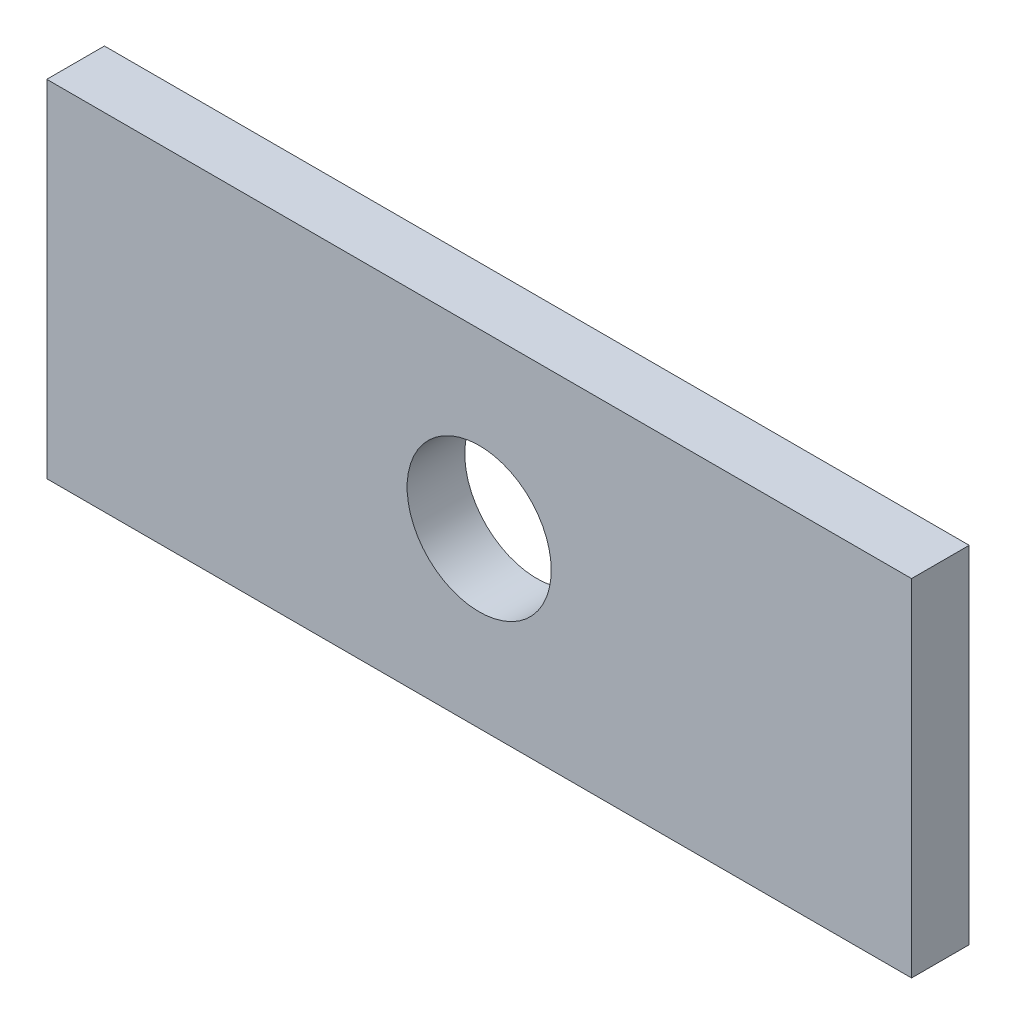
from build123d import *

# Parameters (mm, degrees)
ESQUISSE1_W             = 150
ESQUISSE1_H             = 60
BOSS_EXTRU_1_DEPTH      = 10
ESQUISSE2_R             = 12.5
ENL_V_MAT_EXTRU_1_DEPTH = 10


with BuildPart() as part:
    # Esquisse1 → Boss.-Extru.1 (new body)
    with BuildSketch(Plane.XY):
        Rectangle(ESQUISSE1_W, ESQUISSE1_H)
    extrude(amount=BOSS_EXTRU_1_DEPTH)

    # Esquisse2 → Enl_v. mat.-Extru.1 (cut)
    with BuildSketch(Plane.XY.offset(10)):
        Circle(ESQUISSE2_R)
    extrude(amount=-ENL_V_MAT_EXTRU_1_DEPTH, mode=Mode.SUBTRACT)


solid = part.part
